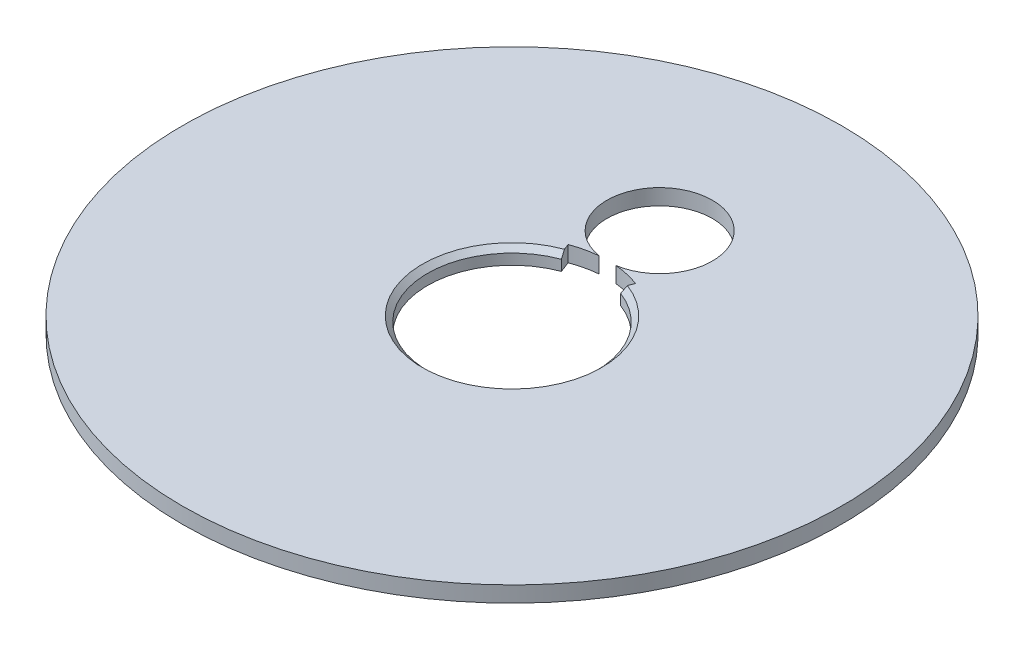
from build123d import *

# Parameters (mm, degrees)
SKETCH1_R           = 31.25
BOSS_EXTRUDE1_DEPTH = 1.5
CHAMFER1_SIZE       = 0.5
SKETCH2_R           = 5
CUT_EXTRUDE1_DEPTH  = 10


with BuildPart() as part:
    # Sketch1 → Boss-Extrude1 (new body)
    with BuildSketch(Plane(origin=(0, 0, 0), x_dir=(1, 0, 0), z_dir=(0, 1, 0))):
        with Locations(Location((0, 0, 0), (0, 0, 270))):
            Circle(SKETCH1_R)
        with BuildLine():
            Line((2.808987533, 7.490633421), (3, 8))
            Line((3, 8), (3.195223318, 8.520595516))
            ThreePointArc((3.195223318, 8.520595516), (0, 9.1), (-3.195223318, 8.520595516))
            Line((-3.195223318, 8.520595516), (-3, 8))
            Line((-3, 8), (-2.808987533, 7.490633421))
            ThreePointArc((-2.808987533, 7.490633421), (0, -8), (2.808987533, 7.490633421))
        make_face(mode=Mode.SUBTRACT)
    extrude(amount=-BOSS_EXTRUDE1_DEPTH)

    # Chamfer1
    chamfer1_edges = [part.edges().sort_by_distance(p)[0] for p in [
        (0, 0, 8),
    ]]
    chamfer(chamfer1_edges, length=CHAMFER1_SIZE)

    # Sketch2 → Cut-Extrude1 (cut)
    with BuildSketch(Plane(origin=(0, 0, 0), x_dir=(1, 0, 0), z_dir=(0, 1, 0))):
        with Locations((0, 14)):
            Circle(SKETCH2_R)
    extrude(amount=-CUT_EXTRUDE1_DEPTH, mode=Mode.SUBTRACT)


solid = part.part
